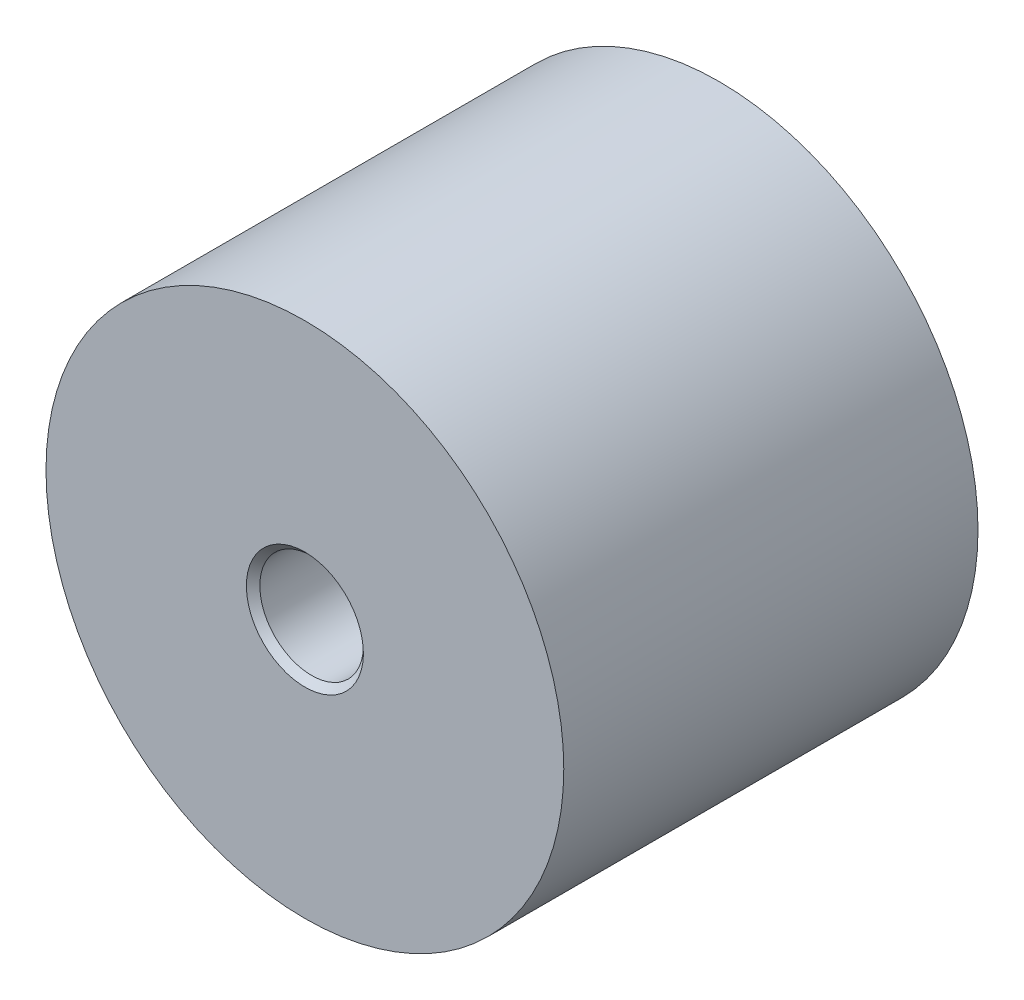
ISO-10303-21;
HEADER;
FILE_DESCRIPTION(('STEP AP214'),'2;1');
FILE_NAME('part.step','',(''),(''),'','','');
FILE_SCHEMA(('AUTOMOTIVE_DESIGN { 1 0 10303 214 1 1 1 1 }'));
ENDSEC;
DATA;
#1=APPLICATION_CONTEXT('core data for automotive mechanical design processes');
#2=APPLICATION_PROTOCOL_DEFINITION('international standard','automotive_design',2000,#1);
#3=PRODUCT_CONTEXT('',#1,'mechanical');
#4=PRODUCT('Part','Part','',(#3));
#5=PRODUCT_RELATED_PRODUCT_CATEGORY('part','',(#4));
#6=PRODUCT_DEFINITION_FORMATION('','',#4);
#7=PRODUCT_DEFINITION_CONTEXT('part definition',#1,'design');
#8=PRODUCT_DEFINITION('design','',#6,#7);
#9=PRODUCT_DEFINITION_SHAPE('','',#8);
#10=(LENGTH_UNIT() NAMED_UNIT(*) SI_UNIT(.MILLI.,.METRE.));
#11=(NAMED_UNIT(*) PLANE_ANGLE_UNIT() SI_UNIT($,.RADIAN.));
#12=(NAMED_UNIT(*) SI_UNIT($,.STERADIAN.) SOLID_ANGLE_UNIT());
#13=UNCERTAINTY_MEASURE_WITH_UNIT(LENGTH_MEASURE(1.E-05),#10,'distance_accuracy_value','');
#14=(GEOMETRIC_REPRESENTATION_CONTEXT(3) GLOBAL_UNCERTAINTY_ASSIGNED_CONTEXT((#13)) GLOBAL_UNIT_ASSIGNED_CONTEXT((#10,
#11,#12)) REPRESENTATION_CONTEXT('',''));
#15=CARTESIAN_POINT('',(0.,0.,0.));
#16=DIRECTION('',(0.,0.,1.));
#17=DIRECTION('',(1.,0.,0.));
#18=AXIS2_PLACEMENT_3D('',#15,#16,#17);
#19=CARTESIAN_POINT('',(0.,0.,1.));
#20=DIRECTION('',(0.,0.,1.));
#21=DIRECTION('',(0.,-1.,0.));
#22=AXIS2_PLACEMENT_3D('',#19,#20,#21);
#23=CYLINDRICAL_SURFACE('',#22,25.);
#24=CARTESIAN_POINT('',(0.,0.,0.));
#25=DIRECTION('',(0.,0.,1.));
#26=DIRECTION('',(0.,-1.,0.));
#27=AXIS2_PLACEMENT_3D('',#24,#25,#26);
#28=CIRCLE('',#27,25.);
#29=CARTESIAN_POINT('',(0.,-25.,0.));
#30=VERTEX_POINT('',#29);
#31=EDGE_CURVE('E23',#30,#30,#28,.T.);
#32=ORIENTED_EDGE('',*,*,#31,.T.);
#33=EDGE_LOOP('',(#32));
#34=FACE_BOUND('',#33,.T.);
#35=CARTESIAN_POINT('',(0.,0.,40.));
#36=DIRECTION('',(0.,0.,-1.));
#37=DIRECTION('',(0.,1.,0.));
#38=AXIS2_PLACEMENT_3D('',#35,#36,#37);
#39=CIRCLE('',#38,25.);
#40=CARTESIAN_POINT('',(0.,25.,40.));
#41=VERTEX_POINT('',#40);
#42=EDGE_CURVE('E32',#41,#41,#39,.T.);
#43=ORIENTED_EDGE('',*,*,#42,.T.);
#44=EDGE_LOOP('',(#43));
#45=FACE_BOUND('',#44,.T.);
#46=ADVANCED_FACE('F12',(#34,#45),#23,.T.);
#47=CARTESIAN_POINT('',(25.,0.,0.));
#48=DIRECTION('',(0.,0.,-1.));
#49=DIRECTION('',(0.,1.,0.));
#50=AXIS2_PLACEMENT_3D('',#47,#48,#49);
#51=PLANE('',#50);
#52=CARTESIAN_POINT('',(0.,0.,0.));
#53=DIRECTION('',(0.,0.,-1.));
#54=DIRECTION('',(0.,1.,0.));
#55=AXIS2_PLACEMENT_3D('',#52,#53,#54);
#56=CIRCLE('',#55,5.65);
#57=CARTESIAN_POINT('',(0.,5.65,0.));
#58=VERTEX_POINT('',#57);
#59=EDGE_CURVE('E8',#58,#58,#56,.F.);
#60=ORIENTED_EDGE('',*,*,#59,.T.);
#61=EDGE_LOOP('',(#60));
#62=FACE_BOUND('',#61,.T.);
#63=ORIENTED_EDGE('',*,*,#31,.F.);
#64=EDGE_LOOP('',(#63));
#65=FACE_BOUND('',#64,.T.);
#66=ADVANCED_FACE('F58',(#62,#65),#51,.T.);
#67=CARTESIAN_POINT('',(0.,0.,0.));
#68=DIRECTION('',(0.,0.,1.));
#69=DIRECTION('',(0.,-1.,0.));
#70=AXIS2_PLACEMENT_3D('',#67,#68,#69);
#71=CYLINDRICAL_SURFACE('',#70,5.);
#72=CARTESIAN_POINT('',(0.,0.,0.65));
#73=DIRECTION('',(0.,0.,-1.));
#74=DIRECTION('',(0.,1.,0.));
#75=AXIS2_PLACEMENT_3D('',#72,#73,#74);
#76=CIRCLE('',#75,5.);
#77=CARTESIAN_POINT('',(0.,5.,0.65));
#78=VERTEX_POINT('',#77);
#79=EDGE_CURVE('E19',#78,#78,#76,.T.);
#80=ORIENTED_EDGE('',*,*,#79,.T.);
#81=EDGE_LOOP('',(#80));
#82=FACE_BOUND('',#81,.T.);
#83=CARTESIAN_POINT('',(0.,0.,10.));
#84=DIRECTION('',(0.,0.,-1.));
#85=DIRECTION('',(0.,1.,0.));
#86=AXIS2_PLACEMENT_3D('',#83,#84,#85);
#87=CIRCLE('',#86,5.);
#88=CARTESIAN_POINT('',(0.,5.,10.));
#89=VERTEX_POINT('',#88);
#90=EDGE_CURVE('E27',#89,#89,#87,.T.);
#91=ORIENTED_EDGE('',*,*,#90,.F.);
#92=EDGE_LOOP('',(#91));
#93=FACE_BOUND('',#92,.T.);
#94=ADVANCED_FACE('F63',(#82,#93),#71,.F.);
#95=CARTESIAN_POINT('',(0.,0.,10.));
#96=DIRECTION('',(0.,0.,-1.));
#97=DIRECTION('',(0.,1.,0.));
#98=AXIS2_PLACEMENT_3D('',#95,#96,#97);
#99=PLANE('',#98);
#100=ORIENTED_EDGE('',*,*,#90,.T.);
#101=EDGE_LOOP('',(#100));
#102=FACE_BOUND('',#101,.T.);
#103=ADVANCED_FACE('F69',(#102),#99,.T.);
#104=CARTESIAN_POINT('',(0.,0.,0.65));
#105=DIRECTION('',(0.,0.,-1.));
#106=DIRECTION('',(0.,1.,0.));
#107=AXIS2_PLACEMENT_3D('',#104,#105,#106);
#108=CONICAL_SURFACE('',#107,5.,0.785398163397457);
#109=ORIENTED_EDGE('',*,*,#59,.F.);
#110=EDGE_LOOP('',(#109));
#111=FACE_BOUND('',#110,.T.);
#112=ORIENTED_EDGE('',*,*,#79,.F.);
#113=EDGE_LOOP('',(#112));
#114=FACE_BOUND('',#113,.T.);
#115=ADVANCED_FACE('F14',(#111,#114),#108,.F.);
#116=CARTESIAN_POINT('',(25.,0.,40.));
#117=DIRECTION('',(0.,0.,1.));
#118=DIRECTION('',(0.,-1.,0.));
#119=AXIS2_PLACEMENT_3D('',#116,#117,#118);
#120=PLANE('',#119);
#121=CARTESIAN_POINT('',(0.,0.,40.));
#122=DIRECTION('',(0.,0.,-1.));
#123=DIRECTION('',(0.,1.,0.));
#124=AXIS2_PLACEMENT_3D('',#121,#122,#123);
#125=CIRCLE('',#124,5.65);
#126=CARTESIAN_POINT('',(0.,5.65,40.));
#127=VERTEX_POINT('',#126);
#128=EDGE_CURVE('E35',#127,#127,#125,.T.);
#129=ORIENTED_EDGE('',*,*,#128,.T.);
#130=EDGE_LOOP('',(#129));
#131=FACE_BOUND('',#130,.T.);
#132=ORIENTED_EDGE('',*,*,#42,.F.);
#133=EDGE_LOOP('',(#132));
#134=FACE_BOUND('',#133,.T.);
#135=ADVANCED_FACE('F73',(#131,#134),#120,.T.);
#136=CARTESIAN_POINT('',(0.,0.,40.));
#137=DIRECTION('',(0.,0.,1.));
#138=DIRECTION('',(0.,-1.,0.));
#139=AXIS2_PLACEMENT_3D('',#136,#137,#138);
#140=CONICAL_SURFACE('',#139,5.65,0.78539816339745);
#141=CARTESIAN_POINT('',(0.,0.,39.35));
#142=DIRECTION('',(0.,0.,-1.));
#143=DIRECTION('',(0.,1.,0.));
#144=AXIS2_PLACEMENT_3D('',#141,#142,#143);
#145=CIRCLE('',#144,5.);
#146=CARTESIAN_POINT('',(0.,5.,39.35));
#147=VERTEX_POINT('',#146);
#148=EDGE_CURVE('E38',#147,#147,#145,.T.);
#149=ORIENTED_EDGE('',*,*,#148,.T.);
#150=EDGE_LOOP('',(#149));
#151=FACE_BOUND('',#150,.T.);
#152=ORIENTED_EDGE('',*,*,#128,.F.);
#153=EDGE_LOOP('',(#152));
#154=FACE_BOUND('',#153,.T.);
#155=ADVANCED_FACE('F55',(#151,#154),#140,.F.);
#156=CARTESIAN_POINT('',(0.,0.,0.));
#157=DIRECTION('',(0.,0.,-1.));
#158=DIRECTION('',(0.,1.,0.));
#159=AXIS2_PLACEMENT_3D('',#156,#157,#158);
#160=CYLINDRICAL_SURFACE('',#159,5.);
#161=CARTESIAN_POINT('',(0.,0.,30.));
#162=DIRECTION('',(0.,0.,-1.));
#163=DIRECTION('',(0.,1.,0.));
#164=AXIS2_PLACEMENT_3D('',#161,#162,#163);
#165=CIRCLE('',#164,5.);
#166=CARTESIAN_POINT('',(0.,5.,30.));
#167=VERTEX_POINT('',#166);
#168=EDGE_CURVE('E41',#167,#167,#165,.T.);
#169=ORIENTED_EDGE('',*,*,#168,.T.);
#170=EDGE_LOOP('',(#169));
#171=FACE_BOUND('',#170,.T.);
#172=ORIENTED_EDGE('',*,*,#148,.F.);
#173=EDGE_LOOP('',(#172));
#174=FACE_BOUND('',#173,.T.);
#175=ADVANCED_FACE('F45',(#171,#174),#160,.F.);
#176=CARTESIAN_POINT('',(5.,0.,30.));
#177=DIRECTION('',(0.,0.,1.));
#178=DIRECTION('',(0.,-1.,0.));
#179=AXIS2_PLACEMENT_3D('',#176,#177,#178);
#180=PLANE('',#179);
#181=ORIENTED_EDGE('',*,*,#168,.F.);
#182=EDGE_LOOP('',(#181));
#183=FACE_BOUND('',#182,.T.);
#184=ADVANCED_FACE('F48',(#183),#180,.T.);
#185=CLOSED_SHELL('',(#46,#66,#94,#103,#115,#135,#155,#175,#184));
#186=MANIFOLD_SOLID_BREP('B1',#185);
#187=ADVANCED_BREP_SHAPE_REPRESENTATION('',(#18,#186),#14);
#188=SHAPE_DEFINITION_REPRESENTATION(#9,#187);
ENDSEC;
END-ISO-10303-21;
